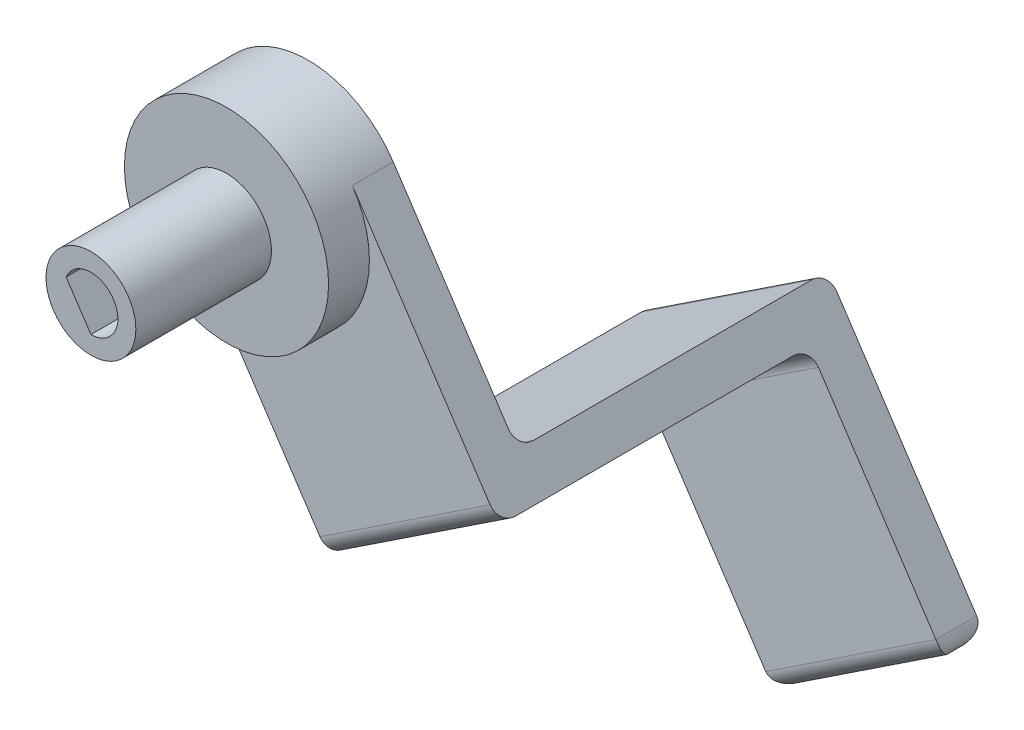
from build123d import *

# Parameters (mm, degrees)
SKETCH1_R                = 5.5
BOSS_EXTRUDE1_DEPTH      = 6.6
BOSS_EXTRUDE4_START      = 10
SKETCH5_R                = 5.5
BOSS_EXTRUDE4_DEPTH      = 10
SKETCH6_R                = 12.5
BOSS_EXTRUDE5_DEPTH      = 10
BOSS_EXTRUDE6_DEPTH      = 20
BOSS_EXTRUDE6_DEPTH_BACK = 12.5
SKETCH25_W               = 25
SKETCH25_H               = 5
BOSS_EXTRUDE7_DEPTH      = 38
SKETCH27_W               = 25
SKETCH27_H               = 5
BOSS_EXTRUDE8_DEPTH      = 30
FILLET1_R                = 2


with BuildPart() as part:
    # Sketch1 → Boss-Extrude1 (new body)
    with BuildSketch(Plane.XY):
        with Locations((0, 3.3)):
            Circle(SKETCH1_R)
        with BuildLine():
            Line((0, 0), (-3.040239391, 4.583333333))
            ThreePointArc((-3.040239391, 4.583333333), (2.75, 5.124143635), (0, 0))
        make_face(mode=Mode.SUBTRACT)
    extrude(amount=BOSS_EXTRUDE1_DEPTH)

    # Sketch5 → Boss-Extrude4 (add)
    with BuildSketch(Plane(origin=(0, 0, 0), x_dir=(-1, 0, 0), z_dir=(0, 0, -1)).offset(BOSS_EXTRUDE4_START)):
        with Locations((0, 3.3)):
            Circle(SKETCH5_R)
    extrude(amount=-BOSS_EXTRUDE4_DEPTH)

    # Sketch6 → Boss-Extrude5 (add)
    with BuildSketch(Plane(origin=(0, 0, -10), x_dir=(-1, 0, 0), z_dir=(0, 0, -1))):
        with Locations((0, 3.3)):
            Circle(SKETCH6_R)
    extrude(amount=BOSS_EXTRUDE5_DEPTH)

    # Sketch25 → Boss-Extrude6 (add, two sides: drawn at the far end of the back side and taken through both)
    with BuildSketch(Plane(origin=(5.389515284, -8.125, 0), x_dir=(-0.8333333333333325, -0.5527707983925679, 0), z_dir=(0.5527707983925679, -0.8333333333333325, 0)).offset(-BOSS_EXTRUDE6_DEPTH_BACK)):
        with Locations((-1.824143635, 17.5)):
            Rectangle(SKETCH25_W, SKETCH25_H)
    extrude(amount=BOSS_EXTRUDE6_DEPTH + BOSS_EXTRUDE6_DEPTH_BACK)

    # Sketch26 → Boss-Extrude7 (add)
    with BuildSketch(Plane(origin=(0, 0, -20), x_dir=(-1, 0, 0), z_dir=(0, 0, -1))):
        Polygon((-28.381717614, -16.873698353), (-25.617863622, -12.707031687), (-4.784530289, -26.526301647), (-7.548384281, -30.692968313), align=None)
    extrude(amount=BOSS_EXTRUDE7_DEPTH)

    # Sketch27 → Boss-Extrude8 (add)
    with BuildSketch(Plane(origin=(16.444931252, -24.791666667, 0), x_dir=(0.8333333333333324, 0.552770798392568, 0), z_dir=(0.552770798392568, -0.8333333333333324, 0))):
        with Locations((1.824143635, -55.5)):
            Rectangle(SKETCH27_W, SKETCH27_H)
    extrude(amount=BOSS_EXTRUDE8_DEPTH)

    # Fillet1
    fillet1_edges = [part.edges().sort_by_distance(p)[0] for p in [
        (17.965050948, -23.783333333, -15),
        (15.201196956, -19.616666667, -20),
        (15.201196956, -19.616666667, -58),
        (17.965050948, -23.783333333, -53),
        (24.131508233, -55.692968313, -55.5),
        (34.5481749, -48.783333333, -58),
        (44.964841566, -41.873698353, -55.5),
        (34.5481749, -48.783333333, -53),
    ]]
    fillet(fillet1_edges, radius=FILLET1_R)


solid = part.part
